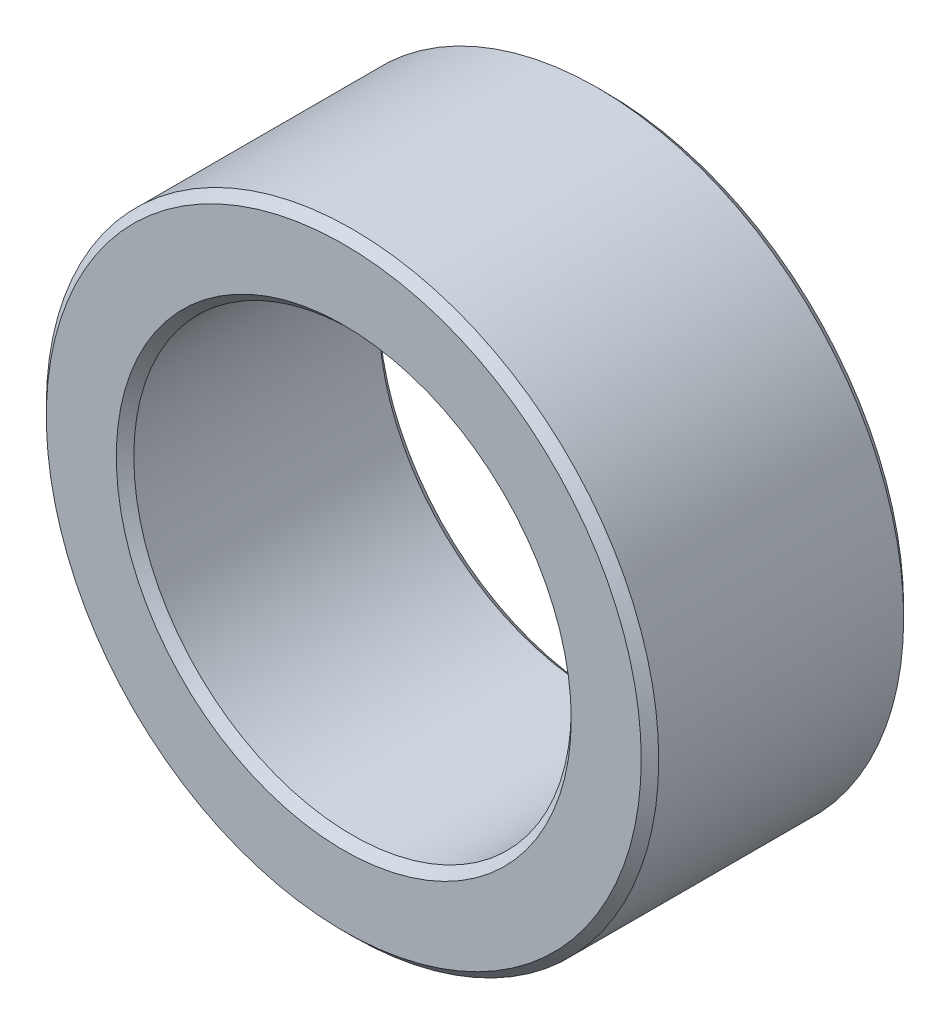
ISO-10303-21;
HEADER;
FILE_DESCRIPTION(('STEP AP214'),'2;1');
FILE_NAME('part.step','',(''),(''),'','','');
FILE_SCHEMA(('AUTOMOTIVE_DESIGN { 1 0 10303 214 1 1 1 1 }'));
ENDSEC;
DATA;
#1=APPLICATION_CONTEXT('core data for automotive mechanical design processes');
#2=APPLICATION_PROTOCOL_DEFINITION('international standard','automotive_design',2000,#1);
#3=PRODUCT_CONTEXT('',#1,'mechanical');
#4=PRODUCT('Part','Part','',(#3));
#5=PRODUCT_RELATED_PRODUCT_CATEGORY('part','',(#4));
#6=PRODUCT_DEFINITION_FORMATION('','',#4);
#7=PRODUCT_DEFINITION_CONTEXT('part definition',#1,'design');
#8=PRODUCT_DEFINITION('design','',#6,#7);
#9=PRODUCT_DEFINITION_SHAPE('','',#8);
#10=(LENGTH_UNIT() NAMED_UNIT(*) SI_UNIT(.MILLI.,.METRE.));
#11=(NAMED_UNIT(*) PLANE_ANGLE_UNIT() SI_UNIT($,.RADIAN.));
#12=(NAMED_UNIT(*) SI_UNIT($,.STERADIAN.) SOLID_ANGLE_UNIT());
#13=UNCERTAINTY_MEASURE_WITH_UNIT(LENGTH_MEASURE(1.E-05),#10,'distance_accuracy_value','');
#14=(GEOMETRIC_REPRESENTATION_CONTEXT(3) GLOBAL_UNCERTAINTY_ASSIGNED_CONTEXT((#13)) GLOBAL_UNIT_ASSIGNED_CONTEXT((#10,
#11,#12)) REPRESENTATION_CONTEXT('',''));
#15=CARTESIAN_POINT('',(0.,0.,0.));
#16=DIRECTION('',(0.,0.,1.));
#17=DIRECTION('',(1.,0.,0.));
#18=AXIS2_PLACEMENT_3D('',#15,#16,#17);
#19=CARTESIAN_POINT('',(0.,0.,15.));
#20=DIRECTION('',(0.,0.,1.));
#21=DIRECTION('',(1.,0.,0.));
#22=AXIS2_PLACEMENT_3D('',#19,#20,#21);
#23=PLANE('',#22);
#24=CARTESIAN_POINT('',(0.,0.,15.));
#25=DIRECTION('',(0.,0.,1.));
#26=DIRECTION('',(1.,0.,0.));
#27=AXIS2_PLACEMENT_3D('',#24,#25,#26);
#28=CIRCLE('',#27,17.);
#29=CARTESIAN_POINT('',(17.,0.,15.));
#30=VERTEX_POINT('',#29);
#31=EDGE_CURVE('E10',#30,#30,#28,.T.);
#32=ORIENTED_EDGE('',*,*,#31,.T.);
#33=EDGE_LOOP('',(#32));
#34=FACE_BOUND('',#33,.T.);
#35=CARTESIAN_POINT('',(0.,0.,15.));
#36=DIRECTION('',(0.,0.,1.));
#37=DIRECTION('',(1.,0.,0.));
#38=AXIS2_PLACEMENT_3D('',#35,#36,#37);
#39=CIRCLE('',#38,13.);
#40=CARTESIAN_POINT('',(13.,0.,15.));
#41=VERTEX_POINT('',#40);
#42=EDGE_CURVE('E39',#41,#41,#39,.F.);
#43=ORIENTED_EDGE('',*,*,#42,.T.);
#44=EDGE_LOOP('',(#43));
#45=FACE_BOUND('',#44,.T.);
#46=ADVANCED_FACE('F32',(#34,#45),#23,.T.);
#47=CARTESIAN_POINT('',(0.,0.,0.));
#48=DIRECTION('',(0.,0.,1.));
#49=DIRECTION('',(1.,0.,0.));
#50=AXIS2_PLACEMENT_3D('',#47,#48,#49);
#51=PLANE('',#50);
#52=CARTESIAN_POINT('',(0.,0.,0.));
#53=DIRECTION('',(0.,0.,1.));
#54=DIRECTION('',(1.,0.,0.));
#55=AXIS2_PLACEMENT_3D('',#52,#53,#54);
#56=CIRCLE('',#55,13.);
#57=CARTESIAN_POINT('',(13.,0.,0.));
#58=VERTEX_POINT('',#57);
#59=EDGE_CURVE('E58',#58,#58,#56,.T.);
#60=ORIENTED_EDGE('',*,*,#59,.T.);
#61=EDGE_LOOP('',(#60));
#62=FACE_BOUND('',#61,.T.);
#63=CARTESIAN_POINT('',(0.,0.,0.));
#64=DIRECTION('',(0.,0.,1.));
#65=DIRECTION('',(1.,0.,0.));
#66=AXIS2_PLACEMENT_3D('',#63,#64,#65);
#67=CIRCLE('',#66,17.);
#68=CARTESIAN_POINT('',(17.,0.,0.));
#69=VERTEX_POINT('',#68);
#70=EDGE_CURVE('E61',#69,#69,#67,.F.);
#71=ORIENTED_EDGE('',*,*,#70,.T.);
#72=EDGE_LOOP('',(#71));
#73=FACE_BOUND('',#72,.T.);
#74=ADVANCED_FACE('F65',(#62,#73),#51,.F.);
#75=CARTESIAN_POINT('',(0.,0.,15.));
#76=DIRECTION('',(0.,0.,-1.));
#77=DIRECTION('',(-1.,0.,0.));
#78=AXIS2_PLACEMENT_3D('',#75,#76,#77);
#79=CYLINDRICAL_SURFACE('',#78,17.5);
#80=CARTESIAN_POINT('',(0.,0.,0.499999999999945));
#81=DIRECTION('',(0.,0.,1.));
#82=DIRECTION('',(1.,0.,0.));
#83=AXIS2_PLACEMENT_3D('',#80,#81,#82);
#84=CIRCLE('',#83,17.5);
#85=CARTESIAN_POINT('',(17.5,0.,0.499999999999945));
#86=VERTEX_POINT('',#85);
#87=EDGE_CURVE('E43',#86,#86,#84,.T.);
#88=ORIENTED_EDGE('',*,*,#87,.T.);
#89=EDGE_LOOP('',(#88));
#90=FACE_BOUND('',#89,.T.);
#91=CARTESIAN_POINT('',(0.,0.,14.5));
#92=DIRECTION('',(0.,0.,1.));
#93=DIRECTION('',(1.,0.,0.));
#94=AXIS2_PLACEMENT_3D('',#91,#92,#93);
#95=CIRCLE('',#94,17.5);
#96=CARTESIAN_POINT('',(17.5,0.,14.5));
#97=VERTEX_POINT('',#96);
#98=EDGE_CURVE('E47',#97,#97,#95,.F.);
#99=ORIENTED_EDGE('',*,*,#98,.T.);
#100=EDGE_LOOP('',(#99));
#101=FACE_BOUND('',#100,.T.);
#102=ADVANCED_FACE('F75',(#90,#101),#79,.T.);
#103=CARTESIAN_POINT('',(0.,0.,15.));
#104=DIRECTION('',(0.,0.,-1.));
#105=DIRECTION('',(-1.,0.,0.));
#106=AXIS2_PLACEMENT_3D('',#103,#104,#105);
#107=CYLINDRICAL_SURFACE('',#106,12.5);
#108=CARTESIAN_POINT('',(0.,0.,0.499999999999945));
#109=DIRECTION('',(0.,0.,1.));
#110=DIRECTION('',(1.,0.,0.));
#111=AXIS2_PLACEMENT_3D('',#108,#109,#110);
#112=CIRCLE('',#111,12.5);
#113=CARTESIAN_POINT('',(12.5,0.,0.499999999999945));
#114=VERTEX_POINT('',#113);
#115=EDGE_CURVE('E52',#114,#114,#112,.F.);
#116=ORIENTED_EDGE('',*,*,#115,.T.);
#117=EDGE_LOOP('',(#116));
#118=FACE_BOUND('',#117,.T.);
#119=CARTESIAN_POINT('',(0.,0.,14.5));
#120=DIRECTION('',(0.,0.,1.));
#121=DIRECTION('',(1.,0.,0.));
#122=AXIS2_PLACEMENT_3D('',#119,#120,#121);
#123=CIRCLE('',#122,12.5);
#124=CARTESIAN_POINT('',(12.5,0.,14.5));
#125=VERTEX_POINT('',#124);
#126=EDGE_CURVE('E55',#125,#125,#123,.T.);
#127=ORIENTED_EDGE('',*,*,#126,.T.);
#128=EDGE_LOOP('',(#127));
#129=FACE_BOUND('',#128,.T.);
#130=ADVANCED_FACE('F78',(#118,#129),#107,.F.);
#131=CARTESIAN_POINT('',(0.,0.,0.));
#132=DIRECTION('',(0.,0.,-1.));
#133=DIRECTION('',(-1.,0.,0.));
#134=AXIS2_PLACEMENT_3D('',#131,#132,#133);
#135=CONICAL_SURFACE('',#134,13.,0.785398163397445);
#136=ORIENTED_EDGE('',*,*,#115,.F.);
#137=EDGE_LOOP('',(#136));
#138=FACE_BOUND('',#137,.T.);
#139=ORIENTED_EDGE('',*,*,#59,.F.);
#140=EDGE_LOOP('',(#139));
#141=FACE_BOUND('',#140,.T.);
#142=ADVANCED_FACE('F71',(#138,#141),#135,.F.);
#143=CARTESIAN_POINT('',(0.,0.,0.499999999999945));
#144=DIRECTION('',(0.,0.,1.));
#145=DIRECTION('',(1.,0.,0.));
#146=AXIS2_PLACEMENT_3D('',#143,#144,#145);
#147=CONICAL_SURFACE('',#146,17.5,0.785398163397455);
#148=ORIENTED_EDGE('',*,*,#70,.F.);
#149=EDGE_LOOP('',(#148));
#150=FACE_BOUND('',#149,.T.);
#151=ORIENTED_EDGE('',*,*,#87,.F.);
#152=EDGE_LOOP('',(#151));
#153=FACE_BOUND('',#152,.T.);
#154=ADVANCED_FACE('F67',(#150,#153),#147,.T.);
#155=CARTESIAN_POINT('',(0.,0.,15.));
#156=DIRECTION('',(0.,0.,-1.));
#157=DIRECTION('',(-1.,0.,0.));
#158=AXIS2_PLACEMENT_3D('',#155,#156,#157);
#159=CONICAL_SURFACE('',#158,17.,0.785398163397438);
#160=ORIENTED_EDGE('',*,*,#98,.F.);
#161=EDGE_LOOP('',(#160));
#162=FACE_BOUND('',#161,.T.);
#163=ORIENTED_EDGE('',*,*,#31,.F.);
#164=EDGE_LOOP('',(#163));
#165=FACE_BOUND('',#164,.T.);
#166=ADVANCED_FACE('F70',(#162,#165),#159,.T.);
#167=CARTESIAN_POINT('',(0.,0.,14.5));
#168=DIRECTION('',(0.,0.,1.));
#169=DIRECTION('',(1.,0.,0.));
#170=AXIS2_PLACEMENT_3D('',#167,#168,#169);
#171=CONICAL_SURFACE('',#170,12.5,0.785398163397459);
#172=ORIENTED_EDGE('',*,*,#42,.F.);
#173=EDGE_LOOP('',(#172));
#174=FACE_BOUND('',#173,.T.);
#175=ORIENTED_EDGE('',*,*,#126,.F.);
#176=EDGE_LOOP('',(#175));
#177=FACE_BOUND('',#176,.T.);
#178=ADVANCED_FACE('F34',(#174,#177),#171,.F.);
#179=CLOSED_SHELL('',(#46,#74,#102,#130,#142,#154,#166,#178));
#180=MANIFOLD_SOLID_BREP('B2',#179);
#181=ADVANCED_BREP_SHAPE_REPRESENTATION('',(#18,#180),#14);
#182=SHAPE_DEFINITION_REPRESENTATION(#9,#181);
ENDSEC;
END-ISO-10303-21;
